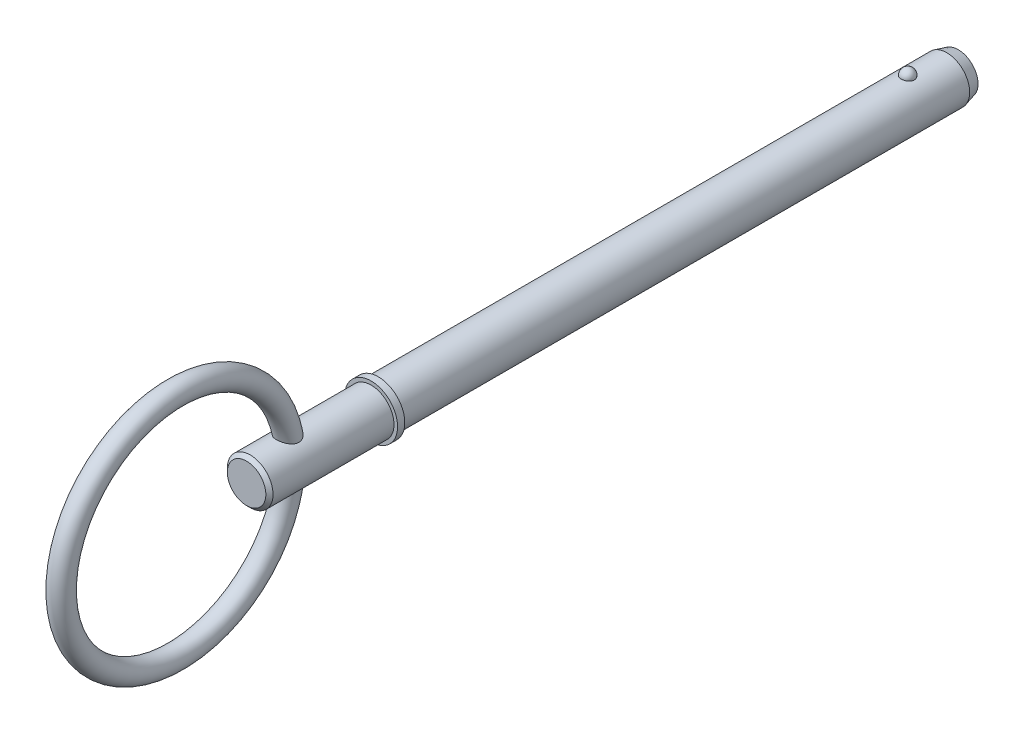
ISO-10303-21;
HEADER;
FILE_DESCRIPTION(('STEP AP214'),'2;1');
FILE_NAME('part.step','',(''),(''),'','','');
FILE_SCHEMA(('AUTOMOTIVE_DESIGN { 1 0 10303 214 1 1 1 1 }'));
ENDSEC;
DATA;
#1=APPLICATION_CONTEXT('core data for automotive mechanical design processes');
#2=APPLICATION_PROTOCOL_DEFINITION('international standard','automotive_design',2000,#1);
#3=PRODUCT_CONTEXT('',#1,'mechanical');
#4=PRODUCT('Part','Part','',(#3));
#5=PRODUCT_RELATED_PRODUCT_CATEGORY('part','',(#4));
#6=PRODUCT_DEFINITION_FORMATION('','',#4);
#7=PRODUCT_DEFINITION_CONTEXT('part definition',#1,'design');
#8=PRODUCT_DEFINITION('design','',#6,#7);
#9=PRODUCT_DEFINITION_SHAPE('','',#8);
#10=(LENGTH_UNIT() NAMED_UNIT(*) SI_UNIT(.MILLI.,.METRE.));
#11=(NAMED_UNIT(*) PLANE_ANGLE_UNIT() SI_UNIT($,.RADIAN.));
#12=(NAMED_UNIT(*) SI_UNIT($,.STERADIAN.) SOLID_ANGLE_UNIT());
#13=UNCERTAINTY_MEASURE_WITH_UNIT(LENGTH_MEASURE(1.E-05),#10,'distance_accuracy_value','');
#14=(GEOMETRIC_REPRESENTATION_CONTEXT(3) GLOBAL_UNCERTAINTY_ASSIGNED_CONTEXT((#13)) GLOBAL_UNIT_ASSIGNED_CONTEXT((#10,
#11,#12)) REPRESENTATION_CONTEXT('',''));
#15=CARTESIAN_POINT('',(0.,0.,0.));
#16=DIRECTION('',(0.,0.,1.));
#17=DIRECTION('',(1.,0.,0.));
#18=AXIS2_PLACEMENT_3D('',#15,#16,#17);
#19=CARTESIAN_POINT('',(0.,0.,72.6));
#20=DIRECTION('',(0.,0.,-1.));
#21=DIRECTION('',(-1.,0.,0.));
#22=AXIS2_PLACEMENT_3D('',#19,#20,#21);
#23=CYLINDRICAL_SURFACE('',#22,3.175);
#24=CARTESIAN_POINT('',(0.90060722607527,3.0445905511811,-0.910000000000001));
#25=CARTESIAN_POINT('',(0.90060646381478,3.04459122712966,-0.859144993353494));
#26=CARTESIAN_POINT('',(0.896466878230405,3.04582460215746,-0.808280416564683));
#27=CARTESIAN_POINT('',(0.88000740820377,3.05062019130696,-0.707994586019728));
#28=CARTESIAN_POINT('',(0.86768478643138,3.05418318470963,-0.658573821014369));
#29=CARTESIAN_POINT('',(0.835170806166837,3.06323316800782,-0.562604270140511));
#30=CARTESIAN_POINT('',(0.814982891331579,3.0687193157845,-0.516054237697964));
#31=CARTESIAN_POINT('',(0.767236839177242,3.08100268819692,-0.427093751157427));
#32=CARTESIAN_POINT('',(0.739678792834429,3.08779989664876,-0.384683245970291));
#33=CARTESIAN_POINT('',(0.677715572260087,3.10198953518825,-0.304951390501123));
#34=CARTESIAN_POINT('',(0.643275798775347,3.10938485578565,-0.267657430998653));
#35=CARTESIAN_POINT('',(0.568522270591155,3.12391647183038,-0.199446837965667));
#36=CARTESIAN_POINT('',(0.528208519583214,3.13105276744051,-0.168530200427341));
#37=CARTESIAN_POINT('',(0.442911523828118,3.14425008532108,-0.114021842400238));
#38=CARTESIAN_POINT('',(0.397942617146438,3.15031426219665,-0.0904084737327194));
#39=CARTESIAN_POINT('',(0.304493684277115,3.16071443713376,-0.051061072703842));
#40=CARTESIAN_POINT('',(0.256014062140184,3.1650506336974,-0.0353261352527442));
#41=CARTESIAN_POINT('',(0.15789136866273,3.17144549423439,-0.0124151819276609));
#42=CARTESIAN_POINT('',(0.108287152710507,3.1735453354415,-0.00508422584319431));
#43=CARTESIAN_POINT('',(0.0085070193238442,3.17538048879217,0.00133254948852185));
#44=CARTESIAN_POINT('',(-0.0416688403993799,3.17511603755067,0.000419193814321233));
#45=CARTESIAN_POINT('',(-0.140377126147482,3.17227395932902,-0.00954840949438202));
#46=CARTESIAN_POINT('',(-0.188922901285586,3.16973088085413,-0.0184810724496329));
#47=CARTESIAN_POINT('',(-0.283780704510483,3.16265029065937,-0.0440659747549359));
#48=CARTESIAN_POINT('',(-0.330092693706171,3.15811274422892,-0.0607183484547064));
#49=CARTESIAN_POINT('',(-0.419493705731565,3.1474895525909,-0.10140675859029));
#50=CARTESIAN_POINT('',(-0.462561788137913,3.14139480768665,-0.125486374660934));
#51=CARTESIAN_POINT('',(-0.54404237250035,3.12831396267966,-0.180346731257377));
#52=CARTESIAN_POINT('',(-0.582454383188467,3.12132776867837,-0.21112817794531));
#53=CARTESIAN_POINT('',(-0.654371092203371,3.10705591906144,-0.279257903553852));
#54=CARTESIAN_POINT('',(-0.687763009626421,3.09976707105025,-0.316724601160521));
#55=CARTESIAN_POINT('',(-0.747869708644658,3.08581767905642,-0.396782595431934));
#56=CARTESIAN_POINT('',(-0.774583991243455,3.07915718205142,-0.43937427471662));
#57=CARTESIAN_POINT('',(-0.820959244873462,3.06712152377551,-0.529074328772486));
#58=CARTESIAN_POINT('',(-0.840531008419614,3.06176288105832,-0.576231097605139));
#59=CARTESIAN_POINT('',(-0.871672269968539,3.0530437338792,-0.673291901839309));
#60=CARTESIAN_POINT('',(-0.883242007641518,3.04968316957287,-0.723195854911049));
#61=CARTESIAN_POINT('',(-0.898057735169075,3.04535343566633,-0.824104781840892));
#62=CARTESIAN_POINT('',(-0.901339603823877,3.04437395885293,-0.875104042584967));
#63=CARTESIAN_POINT('',(-0.89960137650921,3.04488803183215,-0.976947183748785));
#64=CARTESIAN_POINT('',(-0.894581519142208,3.04638151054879,-1.02779106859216));
#65=CARTESIAN_POINT('',(-0.876414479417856,3.051656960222,-1.12760218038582));
#66=CARTESIAN_POINT('',(-0.863310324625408,3.05542681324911,-1.17657789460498));
#67=CARTESIAN_POINT('',(-0.82933491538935,3.06482253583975,-1.27156757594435));
#68=CARTESIAN_POINT('',(-0.808463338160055,3.07044848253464,-1.31758141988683));
#69=CARTESIAN_POINT('',(-0.759325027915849,3.08296842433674,-1.40563218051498));
#70=CARTESIAN_POINT('',(-0.731017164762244,3.08986940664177,-1.44764515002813));
#71=CARTESIAN_POINT('',(-0.667767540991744,3.10415201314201,-1.52624913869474));
#72=CARTESIAN_POINT('',(-0.632825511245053,3.11153365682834,-1.56283993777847));
#73=CARTESIAN_POINT('',(-0.557049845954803,3.12598962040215,-1.62972906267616));
#74=CARTESIAN_POINT('',(-0.516193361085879,3.13306260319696,-1.66000181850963));
#75=CARTESIAN_POINT('',(-0.42979268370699,3.14607829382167,-1.7132172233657));
#76=CARTESIAN_POINT('',(-0.384248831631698,3.15202108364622,-1.73616040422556));
#77=CARTESIAN_POINT('',(-0.290370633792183,3.16204171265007,-1.77380927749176));
#78=CARTESIAN_POINT('',(-0.242079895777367,3.16614263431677,-1.7886174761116));
#79=CARTESIAN_POINT('',(-0.14357928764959,3.17213528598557,-1.81001390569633));
#80=CARTESIAN_POINT('',(-0.0933696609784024,3.1740272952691,-1.81660317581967));
#81=CARTESIAN_POINT('',(0.00648182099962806,3.17537830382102,-1.82132177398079));
#82=CARTESIAN_POINT('',(0.0561153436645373,3.17488455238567,-1.81961539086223));
#83=CARTESIAN_POINT('',(0.154368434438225,3.1716260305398,-1.80816900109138));
#84=CARTESIAN_POINT('',(0.202988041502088,3.16886134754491,-1.79842930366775));
#85=CARTESIAN_POINT('',(0.29764238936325,3.16137318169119,-1.77125024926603));
#86=CARTESIAN_POINT('',(0.343686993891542,3.15665785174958,-1.75384292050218));
#87=CARTESIAN_POINT('',(0.432167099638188,3.14576631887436,-1.71181408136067));
#88=CARTESIAN_POINT('',(0.474602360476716,3.13959001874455,-1.68719209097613));
#89=CARTESIAN_POINT('',(0.555408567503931,3.1263159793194,-1.63094218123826));
#90=CARTESIAN_POINT('',(0.593703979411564,3.11920512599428,-1.59920888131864));
#91=CARTESIAN_POINT('',(0.664472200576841,3.10490064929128,-1.52981493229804));
#92=CARTESIAN_POINT('',(0.696944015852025,3.09770701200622,-1.49215327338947));
#93=CARTESIAN_POINT('',(0.755798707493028,3.08388169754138,-1.41116434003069));
#94=CARTESIAN_POINT('',(0.782059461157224,3.07726269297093,-1.36774610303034));
#95=CARTESIAN_POINT('',(0.827051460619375,3.06547790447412,-1.27699966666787));
#96=CARTESIAN_POINT('',(0.845785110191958,3.06031165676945,-1.22967272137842));
#97=CARTESIAN_POINT('',(0.873798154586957,3.05242388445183,-1.13728658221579));
#98=CARTESIAN_POINT('',(0.883833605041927,3.04951005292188,-1.09247132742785));
#99=CARTESIAN_POINT('',(0.897238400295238,3.0455931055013,-1.00177329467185));
#100=CARTESIAN_POINT('',(0.900607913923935,3.0445899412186,-0.955890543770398));
#101=CARTESIAN_POINT('',(0.90060722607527,3.0445905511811,-0.910000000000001));
#102=B_SPLINE_CURVE_WITH_KNOTS('',3,(#24,#25,#26,#27,#28,#29,#30,#31,#32,#33,#34,#35,#36,#37,
#38,#39,#40,#41,#42,#43,#44,#45,#46,#47,#48,#49,#50,#51,#52,#53,#54,#55,#56,#57,#58,#59,#60,#61,
#62,#63,#64,#65,#66,#67,#68,#69,#70,#71,#72,#73,#74,#75,#76,#77,#78,#79,#80,#81,#82,#83,#84,#85,
#86,#87,#88,#89,#90,#91,#92,#93,#94,#95,#96,#97,#98,#99,#100,#101),.UNSPECIFIED.,.T.,.F.,(4,2,2,
2,2,2,2,2,2,2,2,2,2,2,2,2,2,2,2,2,2,2,2,2,2,2,2,2,2,2,2,2,2,2,2,2,2,2,4),(0.,0.152400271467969,
0.304851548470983,0.45723615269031,0.609618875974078,0.762787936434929,0.915956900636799,
1.06866739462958,1.22136034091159,1.37119044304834,1.52100555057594,1.66858689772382,
1.81617081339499,1.9646377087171,2.1131202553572,2.26455561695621,2.41600229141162,
2.5692805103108,2.72255413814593,2.87516308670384,3.02776764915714,3.1795669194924,
3.33137249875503,3.48403607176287,3.63670583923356,3.78998198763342,3.94324701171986,
4.09453370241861,4.24580126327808,4.39408543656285,4.5423639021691,4.69002878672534,
4.83770349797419,4.9877312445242,5.13778457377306,5.29058018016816,5.44332695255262,
5.58085340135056,5.71837636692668),.UNSPECIFIED.);
#103=CARTESIAN_POINT('',(0.90060722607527,3.0445905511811,-0.910000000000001));
#104=VERTEX_POINT('',#103);
#105=EDGE_CURVE('E102',#104,#104,#102,.T.);
#106=ORIENTED_EDGE('',*,*,#105,.T.);
#107=EDGE_LOOP('',(#106));
#108=FACE_BOUND('',#107,.T.);
#109=CARTESIAN_POINT('',(0.,0.,-6.33399999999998));
#110=DIRECTION('',(0.,0.,-1.));
#111=DIRECTION('',(-1.,0.,0.));
#112=AXIS2_PLACEMENT_3D('',#109,#110,#111);
#113=CIRCLE('',#112,3.175);
#114=CARTESIAN_POINT('',(-3.175,0.,-6.33399999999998));
#115=VERTEX_POINT('',#114);
#116=EDGE_CURVE('E109',#115,#115,#113,.F.);
#117=ORIENTED_EDGE('',*,*,#116,.T.);
#118=EDGE_LOOP('',(#117));
#119=FACE_BOUND('',#118,.T.);
#120=CARTESIAN_POINT('',(0.,0.,72.6));
#121=DIRECTION('',(0.,0.,1.));
#122=DIRECTION('',(1.,0.,0.));
#123=AXIS2_PLACEMENT_3D('',#120,#121,#122);
#124=CIRCLE('',#123,3.175);
#125=CARTESIAN_POINT('',(3.175,0.,72.6));
#126=VERTEX_POINT('',#125);
#127=EDGE_CURVE('E107',#126,#126,#124,.T.);
#128=ORIENTED_EDGE('',*,*,#127,.F.);
#129=EDGE_LOOP('',(#128));
#130=FACE_BOUND('',#129,.T.);
#131=ADVANCED_FACE('F39',(#108,#119,#130),#23,.T.);
#132=CARTESIAN_POINT('',(0.,0.,-7.92));
#133=DIRECTION('',(0.,0.,-1.));
#134=DIRECTION('',(-1.,0.,0.));
#135=AXIS2_PLACEMENT_3D('',#132,#133,#134);
#136=PLANE('',#135);
#137=CARTESIAN_POINT('',(0.,0.,-7.92));
#138=DIRECTION('',(0.,0.,-1.));
#139=DIRECTION('',(-1.,0.,0.));
#140=AXIS2_PLACEMENT_3D('',#137,#138,#139);
#141=CIRCLE('',#140,2.75003258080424);
#142=CARTESIAN_POINT('',(-2.75003258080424,0.,-7.92));
#143=VERTEX_POINT('',#142);
#144=EDGE_CURVE('E143',#143,#143,#141,.T.);
#145=ORIENTED_EDGE('',*,*,#144,.T.);
#146=EDGE_LOOP('',(#145));
#147=FACE_BOUND('',#146,.T.);
#148=ADVANCED_FACE('F88',(#147),#136,.T.);
#149=CARTESIAN_POINT('',(0.,0.,-7.92));
#150=DIRECTION('',(0.,0.,1.));
#151=DIRECTION('',(1.,0.,0.));
#152=AXIS2_PLACEMENT_3D('',#149,#150,#151);
#153=CONICAL_SURFACE('',#152,2.75003258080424,0.261799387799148);
#154=ORIENTED_EDGE('',*,*,#116,.F.);
#155=EDGE_LOOP('',(#154));
#156=FACE_BOUND('',#155,.T.);
#157=ORIENTED_EDGE('',*,*,#144,.F.);
#158=EDGE_LOOP('',(#157));
#159=FACE_BOUND('',#158,.T.);
#160=ADVANCED_FACE('F94',(#156,#159),#153,.T.);
#161=CARTESIAN_POINT('',(0.,3.175,-0.910000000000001));
#162=DIRECTION('',(0.,1.,0.));
#163=DIRECTION('',(0.,0.,-1.));
#164=AXIS2_PLACEMENT_3D('',#161,#162,#163);
#165=SPHERICAL_SURFACE('',#164,0.91);
#166=ORIENTED_EDGE('',*,*,#105,.F.);
#167=EDGE_LOOP('',(#166));
#168=FACE_BOUND('',#167,.T.);
#169=ADVANCED_FACE('F112',(#168),#165,.T.);
#170=CARTESIAN_POINT('',(0.,0.,72.6));
#171=DIRECTION('',(0.,0.,-1.));
#172=DIRECTION('',(-1.,0.,0.));
#173=AXIS2_PLACEMENT_3D('',#170,#171,#172);
#174=PLANE('',#173);
#175=ORIENTED_EDGE('',*,*,#127,.T.);
#176=EDGE_LOOP('',(#175));
#177=FACE_BOUND('',#176,.T.);
#178=CARTESIAN_POINT('',(0.,0.,72.6));
#179=DIRECTION('',(0.,0.,-1.));
#180=DIRECTION('',(-1.,0.,0.));
#181=AXIS2_PLACEMENT_3D('',#178,#179,#180);
#182=CIRCLE('',#181,3.675);
#183=CARTESIAN_POINT('',(-3.675,0.,72.6));
#184=VERTEX_POINT('',#183);
#185=EDGE_CURVE('E108',#184,#184,#182,.T.);
#186=ORIENTED_EDGE('',*,*,#185,.T.);
#187=EDGE_LOOP('',(#186));
#188=FACE_BOUND('',#187,.T.);
#189=ADVANCED_FACE('F116',(#177,#188),#174,.T.);
#190=CARTESIAN_POINT('',(0.,0.,33.7287874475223));
#191=DIRECTION('',(0.,0.,-1.));
#192=DIRECTION('',(-1.,0.,0.));
#193=AXIS2_PLACEMENT_3D('',#190,#191,#192);
#194=CYLINDRICAL_SURFACE('',#193,3.675);
#195=CARTESIAN_POINT('',(0.,0.,73.6));
#196=DIRECTION('',(0.,0.,-1.));
#197=DIRECTION('',(-1.,0.,0.));
#198=AXIS2_PLACEMENT_3D('',#195,#196,#197);
#199=CIRCLE('',#198,3.675);
#200=CARTESIAN_POINT('',(-3.675,0.,73.6));
#201=VERTEX_POINT('',#200);
#202=EDGE_CURVE('E133',#201,#201,#199,.T.);
#203=ORIENTED_EDGE('',*,*,#202,.T.);
#204=EDGE_LOOP('',(#203));
#205=FACE_BOUND('',#204,.T.);
#206=ORIENTED_EDGE('',*,*,#185,.F.);
#207=EDGE_LOOP('',(#206));
#208=FACE_BOUND('',#207,.T.);
#209=ADVANCED_FACE('F120',(#205,#208),#194,.T.);
#210=CARTESIAN_POINT('',(0.,3.675,73.6));
#211=DIRECTION('',(0.,0.,1.));
#212=DIRECTION('',(1.,0.,0.));
#213=AXIS2_PLACEMENT_3D('',#210,#211,#212);
#214=PLANE('',#213);
#215=CARTESIAN_POINT('',(0.,0.,73.6));
#216=DIRECTION('',(0.,0.,1.));
#217=DIRECTION('',(1.,0.,0.));
#218=AXIS2_PLACEMENT_3D('',#215,#216,#217);
#219=CIRCLE('',#218,3.175);
#220=CARTESIAN_POINT('',(3.175,0.,73.6));
#221=VERTEX_POINT('',#220);
#222=EDGE_CURVE('E111',#221,#221,#219,.T.);
#223=ORIENTED_EDGE('',*,*,#222,.F.);
#224=EDGE_LOOP('',(#223));
#225=FACE_BOUND('',#224,.T.);
#226=ORIENTED_EDGE('',*,*,#202,.F.);
#227=EDGE_LOOP('',(#226));
#228=FACE_BOUND('',#227,.T.);
#229=ADVANCED_FACE('F85',(#225,#228),#214,.T.);
#230=CARTESIAN_POINT('',(0.,0.,90.89));
#231=DIRECTION('',(0.,0.,-1.));
#232=DIRECTION('',(-1.,0.,0.));
#233=AXIS2_PLACEMENT_3D('',#230,#231,#232);
#234=CYLINDRICAL_SURFACE('',#233,3.175);
#235=CARTESIAN_POINT('',(-0.793622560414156,-3.07421343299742,83.8949618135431));
#236=CARTESIAN_POINT('',(-0.723928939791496,-3.09220199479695,83.8540743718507));
#237=CARTESIAN_POINT('',(-0.650537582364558,-3.10860299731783,83.8186572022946));
#238=CARTESIAN_POINT('',(-0.498225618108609,-3.13662262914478,83.75960803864));
#239=CARTESIAN_POINT('',(-0.41929921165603,-3.14823615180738,83.735988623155));
#240=CARTESIAN_POINT('',(-0.258022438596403,-3.16553731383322,83.7011787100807));
#241=CARTESIAN_POINT('',(-0.175668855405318,-3.17121924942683,83.6900001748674));
#242=CARTESIAN_POINT('',(-0.010058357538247,-3.17606405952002,83.6804538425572));
#243=CARTESIAN_POINT('',(0.0731982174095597,-3.17522930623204,83.6820813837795));
#244=CARTESIAN_POINT('',(0.236345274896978,-3.16722178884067,83.6979075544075));
#245=CARTESIAN_POINT('',(0.316269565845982,-3.16018772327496,83.7118310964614));
#246=CARTESIAN_POINT('',(0.472429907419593,-3.14064183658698,83.7514871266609));
#247=CARTESIAN_POINT('',(0.548665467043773,-3.12812928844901,83.7772211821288));
#248=CARTESIAN_POINT('',(0.696533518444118,-3.0985857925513,83.8403145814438));
#249=CARTESIAN_POINT('',(0.768085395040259,-3.08149328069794,83.8778336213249));
#250=CARTESIAN_POINT('',(0.903666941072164,-3.04449595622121,83.963584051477));
#251=CARTESIAN_POINT('',(0.967693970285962,-3.02459016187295,84.0118191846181));
#252=CARTESIAN_POINT('',(1.08889306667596,-2.98315111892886,84.1200855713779));
#253=CARTESIAN_POINT('',(1.14572430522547,-2.96158491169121,84.1804869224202));
#254=CARTESIAN_POINT('',(1.24806454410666,-2.91993487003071,84.3106874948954));
#255=CARTESIAN_POINT('',(1.29357550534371,-2.89985077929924,84.3804850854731));
#256=CARTESIAN_POINT('',(1.37094214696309,-2.86407549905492,84.5262600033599));
#257=CARTESIAN_POINT('',(1.40307792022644,-2.84829687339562,84.6020662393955));
#258=CARTESIAN_POINT('',(1.45397574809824,-2.82265933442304,84.7589553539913));
#259=CARTESIAN_POINT('',(1.47274938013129,-2.81279529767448,84.8400335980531));
#260=CARTESIAN_POINT('',(1.49549698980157,-2.80076108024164,84.9979026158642));
#261=CARTESIAN_POINT('',(1.50056337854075,-2.79802369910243,85.0744958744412));
#262=CARTESIAN_POINT('',(1.49933665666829,-2.79868066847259,85.2275541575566));
#263=CARTESIAN_POINT('',(1.49304097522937,-2.80207640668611,85.3040191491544));
#264=CARTESIAN_POINT('',(1.46976618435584,-2.81435249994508,85.4552802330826));
#265=CARTESIAN_POINT('',(1.45272287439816,-2.82326580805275,85.5300634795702));
#266=CARTESIAN_POINT('',(1.40884990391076,-2.84541139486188,85.6760088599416));
#267=CARTESIAN_POINT('',(1.38201642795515,-2.85864535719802,85.7471695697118));
#268=CARTESIAN_POINT('',(1.31496449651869,-2.89016475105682,85.8946079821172));
#269=CARTESIAN_POINT('',(1.27338339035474,-2.90890132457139,85.9701693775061));
#270=CARTESIAN_POINT('',(1.17952729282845,-2.94820796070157,86.1139034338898));
#271=CARTESIAN_POINT('',(1.12723913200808,-2.96878026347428,86.1820668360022));
#272=CARTESIAN_POINT('',(1.00570728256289,-3.01228109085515,86.3173106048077));
#273=CARTESIAN_POINT('',(0.935174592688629,-3.03519170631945,86.3832498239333));
#274=CARTESIAN_POINT('',(0.782605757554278,-3.07805054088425,86.5013215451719));
#275=CARTESIAN_POINT('',(0.700588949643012,-3.09800362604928,86.5534768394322));
#276=CARTESIAN_POINT('',(0.54900367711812,-3.12787153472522,86.6296423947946));
#277=CARTESIAN_POINT('',(0.481582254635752,-3.1390487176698,86.6574376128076));
#278=CARTESIAN_POINT('',(0.342696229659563,-3.15722518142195,86.7021563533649));
#279=CARTESIAN_POINT('',(0.27123564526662,-3.16422853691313,86.7190904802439));
#280=CARTESIAN_POINT('',(0.125873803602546,-3.17334230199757,86.7410622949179));
#281=CARTESIAN_POINT('',(0.0519637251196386,-3.17543249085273,86.7460508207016));
#282=CARTESIAN_POINT('',(-0.0956207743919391,-3.17441743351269,86.7436180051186));
#283=CARTESIAN_POINT('',(-0.169295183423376,-3.1713119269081,86.7361960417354));
#284=CARTESIAN_POINT('',(-0.309449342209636,-3.16061694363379,86.7103375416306));
#285=CARTESIAN_POINT('',(-0.376089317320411,-3.15332372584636,86.6926279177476));
#286=CARTESIAN_POINT('',(-0.505583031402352,-3.13517004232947,86.6477876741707));
#287=CARTESIAN_POINT('',(-0.568435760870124,-3.12430863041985,86.6206545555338));
#288=CARTESIAN_POINT('',(-0.694306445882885,-3.09887452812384,86.5555626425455));
#289=CARTESIAN_POINT('',(-0.756907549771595,-3.08406907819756,86.5168937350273));
#290=CARTESIAN_POINT('',(-0.875645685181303,-3.05248288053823,86.4313455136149));
#291=CARTESIAN_POINT('',(-0.931779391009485,-3.03570112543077,86.3844620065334));
#292=CARTESIAN_POINT('',(-1.0463923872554,-2.99832170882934,86.2747926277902));
#293=CARTESIAN_POINT('',(-1.10353654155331,-2.97757338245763,86.2106605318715));
#294=CARTESIAN_POINT('',(-1.20755858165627,-2.93692907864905,86.0742268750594));
#295=CARTESIAN_POINT('',(-1.25442453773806,-2.91703411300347,86.0019159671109));
#296=CARTESIAN_POINT('',(-1.34199791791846,-2.87788786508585,85.8412794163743));
#297=CARTESIAN_POINT('',(-1.38127718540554,-2.85900475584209,85.7520744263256));
#298=CARTESIAN_POINT('',(-1.44406659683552,-2.82781619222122,85.5671839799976));
#299=CARTESIAN_POINT('',(-1.46759319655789,-2.81550387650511,85.4715054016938));
#300=CARTESIAN_POINT('',(-1.49571801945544,-2.8006591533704,85.2845771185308));
#301=CARTESIAN_POINT('',(-1.50169726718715,-2.79741422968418,85.1935980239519));
#302=CARTESIAN_POINT('',(-1.49747735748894,-2.79967890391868,85.0121564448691));
#303=CARTESIAN_POINT('',(-1.48729863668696,-2.80517744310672,84.9216934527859));
#304=CARTESIAN_POINT('',(-1.45348639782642,-2.82281521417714,84.7584626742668));
#305=CARTESIAN_POINT('',(-1.43212237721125,-2.83382344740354,84.6850889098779));
#306=CARTESIAN_POINT('',(-1.37828411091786,-2.86039426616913,84.5433903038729));
#307=CARTESIAN_POINT('',(-1.34580440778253,-2.87595908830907,84.4750679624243));
#308=CARTESIAN_POINT('',(-1.27066760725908,-2.90993532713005,84.3450336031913));
#309=CARTESIAN_POINT('',(-1.22800357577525,-2.9283486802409,84.283326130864));
#310=CARTESIAN_POINT('',(-1.13363307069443,-2.96615489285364,84.1677083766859));
#311=CARTESIAN_POINT('',(-1.08193541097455,-2.98554678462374,84.1137905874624));
#312=CARTESIAN_POINT('',(-0.990573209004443,-3.01675653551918,84.0323094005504));
#313=CARTESIAN_POINT('',(-0.953209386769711,-3.02880489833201,84.0022130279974));
#314=CARTESIAN_POINT('',(-0.875544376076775,-3.0521621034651,83.9457477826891));
#315=CARTESIAN_POINT('',(-0.835242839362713,-3.06347085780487,83.9193793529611));
#316=CARTESIAN_POINT('',(-0.793622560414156,-3.07421343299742,83.8949618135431));
#317=B_SPLINE_CURVE_WITH_KNOTS('',3,(#235,#236,#237,#238,#239,#240,#241,#242,#243,#244,#245,
#246,#247,#248,#249,#250,#251,#252,#253,#254,#255,#256,#257,#258,#259,#260,#261,#262,#263,#264,
#265,#266,#267,#268,#269,#270,#271,#272,#273,#274,#275,#276,#277,#278,#279,#280,#281,#282,#283,
#284,#285,#286,#287,#288,#289,#290,#291,#292,#293,#294,#295,#296,#297,#298,#299,#300,#301,#302,
#303,#304,#305,#306,#307,#308,#309,#310,#311,#312,#313,#314,#315,#316),.UNSPECIFIED.,.T.,.F.,(4,
2,2,2,2,2,2,2,2,2,2,2,2,2,2,2,2,2,2,2,2,2,2,2,2,2,2,2,2,2,2,2,2,2,2,2,2,2,2,2,4),(0.,
0.248167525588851,0.496599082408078,0.745269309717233,0.99384902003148,1.23700449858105,
1.48019225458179,1.72682894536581,1.97355191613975,2.22939388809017,2.48519151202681,
2.73532416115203,2.98523982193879,3.21455414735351,3.44392036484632,3.67466984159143,
3.90550934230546,4.16925064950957,4.43331832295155,4.72951976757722,5.02522832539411,
5.24564983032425,5.46585579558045,5.68696647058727,5.90808822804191,6.11521387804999,
6.32239449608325,6.54672206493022,6.77116447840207,7.03522663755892,7.29959368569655,
7.59590092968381,7.89189815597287,8.163876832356,8.43551178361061,8.66603557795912,
8.89667271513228,9.1274673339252,9.35803801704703,9.50622339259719,9.6544263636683),.UNSPECIFIED.);
#318=CARTESIAN_POINT('',(-0.793622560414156,-3.07421343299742,83.8949618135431));
#319=VERTEX_POINT('',#318);
#320=EDGE_CURVE('E10',#319,#319,#317,.T.);
#321=ORIENTED_EDGE('',*,*,#320,.F.);
#322=EDGE_LOOP('',(#321));
#323=FACE_BOUND('',#322,.T.);
#324=CARTESIAN_POINT('',(-0.793622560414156,3.07421343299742,83.8949618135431));
#325=CARTESIAN_POINT('',(-0.86460683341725,3.05588589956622,83.9366128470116));
#326=CARTESIAN_POINT('',(-0.931875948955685,3.03587991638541,83.9840114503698));
#327=CARTESIAN_POINT('',(-1.05725170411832,2.99453227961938,84.0893775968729));
#328=CARTESIAN_POINT('',(-1.11534118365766,2.97318822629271,84.1473645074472));
#329=CARTESIAN_POINT('',(-1.22080462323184,2.93146441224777,84.272887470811));
#330=CARTESIAN_POINT('',(-1.26816209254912,2.91108617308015,84.3404379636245));
#331=CARTESIAN_POINT('',(-1.35052787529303,2.87380473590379,84.4835086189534));
#332=CARTESIAN_POINT('',(-1.38554886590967,2.85689797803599,84.5590204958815));
#333=CARTESIAN_POINT('',(-1.44074287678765,2.82945202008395,84.7122947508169));
#334=CARTESIAN_POINT('',(-1.46153301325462,2.81865228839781,84.7897872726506));
#335=CARTESIAN_POINT('',(-1.49023441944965,2.80358650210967,84.9477206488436));
#336=CARTESIAN_POINT('',(-1.49815016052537,2.79931817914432,85.0281604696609));
#337=CARTESIAN_POINT('',(-1.50117056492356,2.79769676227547,85.1840076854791));
#338=CARTESIAN_POINT('',(-1.49708260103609,2.79990784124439,85.2593985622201));
#339=CARTESIAN_POINT('',(-1.4784698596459,2.80977909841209,85.4084983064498));
#340=CARTESIAN_POINT('',(-1.46394166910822,2.8174410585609,85.4822066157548));
#341=CARTESIAN_POINT('',(-1.42400377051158,2.83784609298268,85.6313443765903));
#342=CARTESIAN_POINT('',(-1.39791960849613,2.85090002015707,85.7065484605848));
#343=CARTESIAN_POINT('',(-1.33585690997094,2.8805017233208,85.8520384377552));
#344=CARTESIAN_POINT('',(-1.29987052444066,2.89705226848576,85.9223203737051));
#345=CARTESIAN_POINT('',(-1.21229019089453,2.93489412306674,86.0677405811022));
#346=CARTESIAN_POINT('',(-1.15911759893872,2.95651988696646,86.1418449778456));
#347=CARTESIAN_POINT('',(-1.04143166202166,2.99999612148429,86.2803805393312));
#348=CARTESIAN_POINT('',(-0.976918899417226,3.0218465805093,86.344812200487));
#349=CARTESIAN_POINT('',(-0.845368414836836,3.06106710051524,86.4552302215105));
#350=CARTESIAN_POINT('',(-0.77946649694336,3.0786636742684,86.5024840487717));
#351=CARTESIAN_POINT('',(-0.640261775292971,3.11059085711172,86.5859540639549));
#352=CARTESIAN_POINT('',(-0.566963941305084,3.12492363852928,86.6221775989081));
#353=CARTESIAN_POINT('',(-0.413802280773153,3.14887886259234,86.6818109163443));
#354=CARTESIAN_POINT('',(-0.333888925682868,3.15846114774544,86.7051116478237));
#355=CARTESIAN_POINT('',(-0.170660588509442,3.17146222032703,86.7365717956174));
#356=CARTESIAN_POINT('',(-0.0873493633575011,3.17488763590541,86.7447474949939));
#357=CARTESIAN_POINT('',(0.0674621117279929,3.17509166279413,86.7452317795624));
#358=CARTESIAN_POINT('',(0.138963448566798,3.17274321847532,86.7396242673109));
#359=CARTESIAN_POINT('',(0.27985527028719,3.16342998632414,86.7171581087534));
#360=CARTESIAN_POINT('',(0.349245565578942,3.15646478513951,86.7002984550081));
#361=CARTESIAN_POINT('',(0.483013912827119,3.13875920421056,86.6567119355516));
#362=CARTESIAN_POINT('',(0.54745548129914,3.12808257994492,86.6301513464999));
#363=CARTESIAN_POINT('',(0.671431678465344,3.10383639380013,86.5683782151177));
#364=CARTESIAN_POINT('',(0.73096479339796,3.09026594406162,86.5331630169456));
#365=CARTESIAN_POINT('',(0.852308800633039,3.0591902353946,86.4498716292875));
#366=CARTESIAN_POINT('',(0.91328416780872,3.04140021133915,86.4006877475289));
#367=CARTESIAN_POINT('',(1.0273242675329,3.00480015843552,86.2941850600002));
#368=CARTESIAN_POINT('',(1.08038247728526,2.98598930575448,86.2368596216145));
#369=CARTESIAN_POINT('',(1.18657794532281,2.94557646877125,86.1046952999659));
#370=CARTESIAN_POINT('',(1.23812372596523,2.92405810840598,86.0285445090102));
#371=CARTESIAN_POINT('',(1.32862928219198,2.88406370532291,85.8682796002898));
#372=CARTESIAN_POINT('',(1.36758013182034,2.86558982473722,85.7841598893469));
#373=CARTESIAN_POINT('',(1.43274280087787,2.83359383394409,85.6061421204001));
#374=CARTESIAN_POINT('',(1.45837682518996,2.82030175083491,85.5119863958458));
#375=CARTESIAN_POINT('',(1.49241322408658,2.80245006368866,85.3198495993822));
#376=CARTESIAN_POINT('',(1.50084951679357,2.79787327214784,85.2218764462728));
#377=CARTESIAN_POINT('',(1.49914798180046,2.7987793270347,85.0405073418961));
#378=CARTESIAN_POINT('',(1.49154990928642,2.80288682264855,84.957078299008));
#379=CARTESIAN_POINT('',(1.46253136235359,2.81813655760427,84.7933228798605));
#380=CARTESIAN_POINT('',(1.44111368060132,2.82927737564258,84.7129958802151));
#381=CARTESIAN_POINT('',(1.38785163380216,2.85574398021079,84.5657200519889));
#382=CARTESIAN_POINT('',(1.3572264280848,2.87055627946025,84.4982302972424));
#383=CARTESIAN_POINT('',(1.28612163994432,2.90310901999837,84.3694446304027));
#384=CARTESIAN_POINT('',(1.24564038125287,2.92084995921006,84.308149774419));
#385=CARTESIAN_POINT('',(1.1532082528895,2.95860856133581,84.1894756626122));
#386=CARTESIAN_POINT('',(1.10072548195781,2.97869868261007,84.1325343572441));
#387=CARTESIAN_POINT('',(0.987118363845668,3.01825121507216,84.0277702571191));
#388=CARTESIAN_POINT('',(0.925990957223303,3.03771340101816,83.9799507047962));
#389=CARTESIAN_POINT('',(0.792065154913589,3.07545294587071,83.8913571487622));
#390=CARTESIAN_POINT('',(0.718757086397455,3.09356121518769,83.8512781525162));
#391=CARTESIAN_POINT('',(0.565747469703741,3.12516438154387,83.7833730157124));
#392=CARTESIAN_POINT('',(0.486046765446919,3.13865988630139,83.7555452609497));
#393=CARTESIAN_POINT('',(0.323293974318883,3.15955163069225,83.7130890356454));
#394=CARTESIAN_POINT('',(0.240283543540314,3.16700771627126,83.6983309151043));
#395=CARTESIAN_POINT('',(0.0726303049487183,3.17527774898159,83.6819853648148));
#396=CARTESIAN_POINT('',(-0.012012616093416,3.17609123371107,83.6803988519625));
#397=CARTESIAN_POINT('',(-0.177340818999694,3.17108555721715,83.6902649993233));
#398=CARTESIAN_POINT('',(-0.258061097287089,3.16549698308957,83.7012643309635));
#399=CARTESIAN_POINT('',(-0.416230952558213,3.1486007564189,83.735250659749));
#400=CARTESIAN_POINT('',(-0.493684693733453,3.13730063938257,83.7582218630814));
#401=CARTESIAN_POINT('',(-0.607599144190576,3.11657538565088,83.8018364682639));
#402=CARTESIAN_POINT('',(-0.64599981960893,3.10882447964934,83.8183691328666));
#403=CARTESIAN_POINT('',(-0.721122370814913,3.092262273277,83.8544352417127));
#404=CARTESIAN_POINT('',(-0.757844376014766,3.08345105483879,83.8739684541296));
#405=CARTESIAN_POINT('',(-0.793622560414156,3.07421343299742,83.8949618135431));
#406=B_SPLINE_CURVE_WITH_KNOTS('',3,(#324,#325,#326,#327,#328,#329,#330,#331,#332,#333,#334,
#335,#336,#337,#338,#339,#340,#341,#342,#343,#344,#345,#346,#347,#348,#349,#350,#351,#352,#353,
#354,#355,#356,#357,#358,#359,#360,#361,#362,#363,#364,#365,#366,#367,#368,#369,#370,#371,#372,
#373,#374,#375,#376,#377,#378,#379,#380,#381,#382,#383,#384,#385,#386,#387,#388,#389,#390,#391,
#392,#393,#394,#395,#396,#397,#398,#399,#400,#401,#402,#403,#404,#405),.UNSPECIFIED.,.T.,.F.,(4,
2,2,2,2,2,2,2,2,2,2,2,2,2,2,2,2,2,2,2,2,2,2,2,2,2,2,2,2,2,2,2,2,2,2,2,2,2,2,2,4),(0.,
0.252800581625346,0.506068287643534,0.75972256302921,1.01311541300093,1.25467278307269,
1.49614624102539,1.72175790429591,1.94744335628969,2.18851823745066,2.42978476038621,
2.7098131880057,2.98982723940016,3.23776482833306,3.48553690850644,3.73536921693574,
3.98493240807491,4.19913817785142,4.41336312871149,4.62407643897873,4.83485449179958,
5.07495869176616,5.31525962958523,5.59735778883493,5.87965543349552,6.17335015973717,
6.46646508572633,6.71664398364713,6.96677234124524,7.19253107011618,7.4183282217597,
7.6573166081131,7.89638978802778,8.15162793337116,8.40683243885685,8.65947601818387,
8.91213718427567,9.15597668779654,9.39949531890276,9.5269241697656,9.65434318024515),.UNSPECIFIED.);
#407=CARTESIAN_POINT('',(-0.793622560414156,3.07421343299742,83.8949618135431));
#408=VERTEX_POINT('',#407);
#409=EDGE_CURVE('E51',#408,#408,#406,.T.);
#410=ORIENTED_EDGE('',*,*,#409,.F.);
#411=EDGE_LOOP('',(#410));
#412=FACE_BOUND('',#411,.T.);
#413=CARTESIAN_POINT('',(0.,0.,90.39));
#414=DIRECTION('',(0.,0.,-1.));
#415=DIRECTION('',(-1.,0.,0.));
#416=AXIS2_PLACEMENT_3D('',#413,#414,#415);
#417=CIRCLE('',#416,3.175);
#418=CARTESIAN_POINT('',(-3.175,0.,90.39));
#419=VERTEX_POINT('',#418);
#420=EDGE_CURVE('E64',#419,#419,#417,.T.);
#421=ORIENTED_EDGE('',*,*,#420,.T.);
#422=EDGE_LOOP('',(#421));
#423=FACE_BOUND('',#422,.T.);
#424=ORIENTED_EDGE('',*,*,#222,.T.);
#425=EDGE_LOOP('',(#424));
#426=FACE_BOUND('',#425,.T.);
#427=ADVANCED_FACE('F69',(#323,#412,#423,#426),#234,.T.);
#428=CARTESIAN_POINT('',(0.,0.,90.89));
#429=DIRECTION('',(0.,0.,-1.));
#430=DIRECTION('',(-1.,0.,0.));
#431=AXIS2_PLACEMENT_3D('',#428,#429,#430);
#432=PLANE('',#431);
#433=CARTESIAN_POINT('',(0.,0.,90.89));
#434=DIRECTION('',(0.,0.,-1.));
#435=DIRECTION('',(-1.,0.,0.));
#436=AXIS2_PLACEMENT_3D('',#433,#434,#435);
#437=CIRCLE('',#436,2.67500000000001);
#438=CARTESIAN_POINT('',(-2.67500000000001,0.,90.89));
#439=VERTEX_POINT('',#438);
#440=EDGE_CURVE('E58',#439,#439,#437,.F.);
#441=ORIENTED_EDGE('',*,*,#440,.T.);
#442=EDGE_LOOP('',(#441));
#443=FACE_BOUND('',#442,.T.);
#444=ADVANCED_FACE('F76',(#443),#432,.F.);
#445=CARTESIAN_POINT('',(0.,0.,90.39));
#446=DIRECTION('',(0.,0.,-1.));
#447=DIRECTION('',(-1.,0.,0.));
#448=AXIS2_PLACEMENT_3D('',#445,#446,#447);
#449=CONICAL_SURFACE('',#448,3.175,0.785398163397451);
#450=ORIENTED_EDGE('',*,*,#440,.F.);
#451=EDGE_LOOP('',(#450));
#452=FACE_BOUND('',#451,.T.);
#453=ORIENTED_EDGE('',*,*,#420,.F.);
#454=EDGE_LOOP('',(#453));
#455=FACE_BOUND('',#454,.T.);
#456=ADVANCED_FACE('F41',(#452,#455),#449,.T.);
#457=CARTESIAN_POINT('',(0.,0.,100.765));
#458=DIRECTION('',(1.,0.,0.));
#459=DIRECTION('',(0.,0.,-1.));
#460=AXIS2_PLACEMENT_3D('',#457,#458,#459);
#461=TOROIDAL_SURFACE('',#460,15.875,1.5);
#462=ORIENTED_EDGE('',*,*,#320,.T.);
#463=EDGE_LOOP('',(#462));
#464=FACE_BOUND('',#463,.T.);
#465=ORIENTED_EDGE('',*,*,#409,.T.);
#466=EDGE_LOOP('',(#465));
#467=FACE_BOUND('',#466,.T.);
#468=ADVANCED_FACE('F73',(#464,#467),#461,.T.);
#469=CLOSED_SHELL('',(#131,#148,#160,#169,#189,#209,#229,#427,#444,#456,#468));
#470=MANIFOLD_SOLID_BREP('B2',#469);
#471=ADVANCED_BREP_SHAPE_REPRESENTATION('',(#18,#470),#14);
#472=SHAPE_DEFINITION_REPRESENTATION(#9,#471);
ENDSEC;
END-ISO-10303-21;
